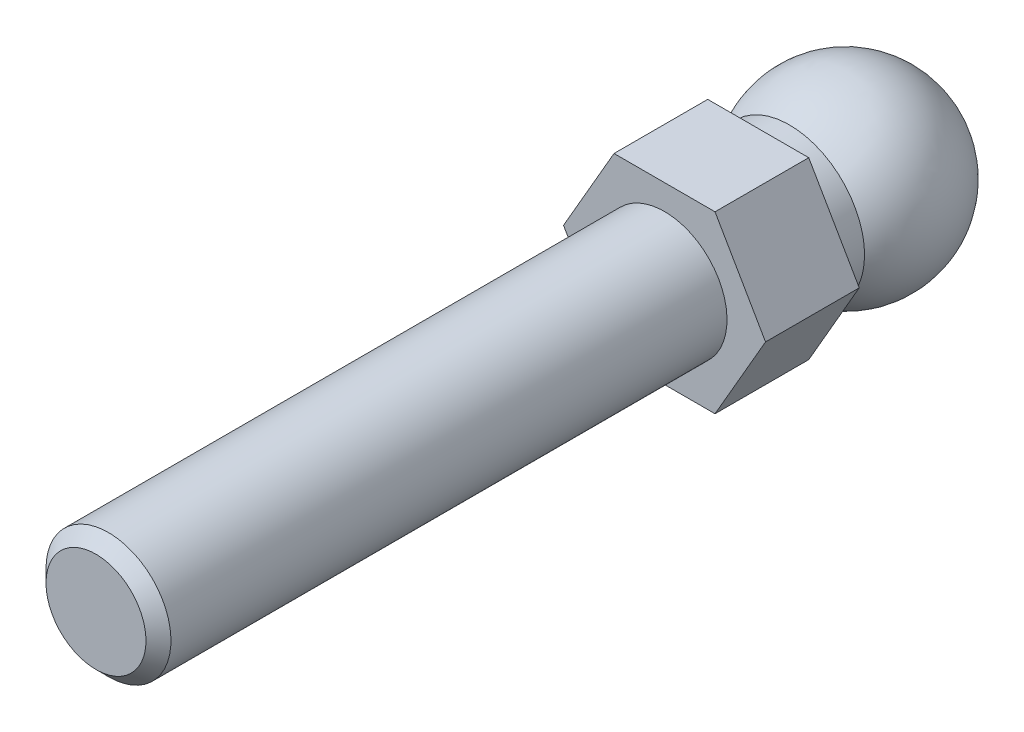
ISO-10303-21;
HEADER;
FILE_DESCRIPTION(('STEP AP214'),'2;1');
FILE_NAME('part.step','',(''),(''),'','','');
FILE_SCHEMA(('AUTOMOTIVE_DESIGN { 1 0 10303 214 1 1 1 1 }'));
ENDSEC;
DATA;
#1=APPLICATION_CONTEXT('core data for automotive mechanical design processes');
#2=APPLICATION_PROTOCOL_DEFINITION('international standard','automotive_design',2000,#1);
#3=PRODUCT_CONTEXT('',#1,'mechanical');
#4=PRODUCT('Part','Part','',(#3));
#5=PRODUCT_RELATED_PRODUCT_CATEGORY('part','',(#4));
#6=PRODUCT_DEFINITION_FORMATION('','',#4);
#7=PRODUCT_DEFINITION_CONTEXT('part definition',#1,'design');
#8=PRODUCT_DEFINITION('design','',#6,#7);
#9=PRODUCT_DEFINITION_SHAPE('','',#8);
#10=(LENGTH_UNIT() NAMED_UNIT(*) SI_UNIT(.MILLI.,.METRE.));
#11=(NAMED_UNIT(*) PLANE_ANGLE_UNIT() SI_UNIT($,.RADIAN.));
#12=(NAMED_UNIT(*) SI_UNIT($,.STERADIAN.) SOLID_ANGLE_UNIT());
#13=UNCERTAINTY_MEASURE_WITH_UNIT(LENGTH_MEASURE(1.E-05),#10,'distance_accuracy_value','');
#14=(GEOMETRIC_REPRESENTATION_CONTEXT(3) GLOBAL_UNCERTAINTY_ASSIGNED_CONTEXT((#13)) GLOBAL_UNIT_ASSIGNED_CONTEXT((#10,
#11,#12)) REPRESENTATION_CONTEXT('',''));
#15=CARTESIAN_POINT('',(0.,0.,0.));
#16=DIRECTION('',(0.,0.,1.));
#17=DIRECTION('',(1.,0.,0.));
#18=AXIS2_PLACEMENT_3D('',#15,#16,#17);
#19=CARTESIAN_POINT('',(0.,0.,0.));
#20=DIRECTION('',(1.,0.,0.));
#21=DIRECTION('',(0.,1.,0.));
#22=AXIS2_PLACEMENT_3D('',#19,#20,#21);
#23=SPHERICAL_SURFACE('',#22,7.5);
#24=CARTESIAN_POINT('',(-7.5,0.,0.));
#25=VERTEX_POINT('',#24);
#26=VERTEX_LOOP('',#25);
#27=FACE_BOUND('',#26,.T.);
#28=CARTESIAN_POINT('',(7.5,0.,0.));
#29=VERTEX_POINT('',#28);
#30=VERTEX_LOOP('',#29);
#31=FACE_BOUND('',#30,.T.);
#32=CARTESIAN_POINT('',(0.,0.,4.5));
#33=DIRECTION('',(0.,0.,1.));
#34=DIRECTION('',(1.,0.,0.));
#35=AXIS2_PLACEMENT_3D('',#32,#33,#34);
#36=CIRCLE('',#35,6.);
#37=CARTESIAN_POINT('',(6.,0.,4.5));
#38=VERTEX_POINT('',#37);
#39=EDGE_CURVE('E20',#38,#38,#36,.T.);
#40=ORIENTED_EDGE('',*,*,#39,.F.);
#41=EDGE_LOOP('',(#40));
#42=FACE_BOUND('',#41,.T.);
#43=ADVANCED_FACE('F16',(#27,#31,#42),#23,.T.);
#44=CARTESIAN_POINT('',(0.,0.,0.));
#45=DIRECTION('',(0.,0.,1.));
#46=DIRECTION('',(1.,0.,0.));
#47=AXIS2_PLACEMENT_3D('',#44,#45,#46);
#48=CYLINDRICAL_SURFACE('',#47,6.);
#49=ORIENTED_EDGE('',*,*,#39,.T.);
#50=EDGE_LOOP('',(#49));
#51=FACE_BOUND('',#50,.T.);
#52=CARTESIAN_POINT('',(0.,0.,7.));
#53=DIRECTION('',(0.,0.,1.));
#54=DIRECTION('',(1.,0.,0.));
#55=AXIS2_PLACEMENT_3D('',#52,#53,#54);
#56=CIRCLE('',#55,6.);
#57=CARTESIAN_POINT('',(6.,0.,7.));
#58=VERTEX_POINT('',#57);
#59=EDGE_CURVE('E79',#58,#58,#56,.F.);
#60=ORIENTED_EDGE('',*,*,#59,.T.);
#61=EDGE_LOOP('',(#60));
#62=FACE_BOUND('',#61,.T.);
#63=ADVANCED_FACE('F74',(#51,#62),#48,.T.);
#64=CARTESIAN_POINT('',(0.,0.,7.));
#65=DIRECTION('',(0.,0.,1.));
#66=DIRECTION('',(1.,0.,0.));
#67=AXIS2_PLACEMENT_3D('',#64,#65,#66);
#68=PLANE('',#67);
#69=ORIENTED_EDGE('',*,*,#59,.F.);
#70=EDGE_LOOP('',(#69));
#71=FACE_BOUND('',#70,.T.);
#72=DIRECTION('',(-0.500000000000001,0.866025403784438,0.));
#73=VECTOR('',#72,1.);
#74=CARTESIAN_POINT('',(4.04145188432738,7.,7.));
#75=LINE('',#74,#73);
#76=CARTESIAN_POINT('',(8.08290376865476,0.,7.));
#77=VERTEX_POINT('',#76);
#78=CARTESIAN_POINT('',(4.04145188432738,7.,7.));
#79=VERTEX_POINT('',#78);
#80=EDGE_CURVE('E81',#77,#79,#75,.T.);
#81=ORIENTED_EDGE('',*,*,#80,.F.);
#82=DIRECTION('',(0.5,0.866025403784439,0.));
#83=VECTOR('',#82,1.);
#84=CARTESIAN_POINT('',(8.08290376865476,0.,7.));
#85=LINE('',#84,#83);
#86=CARTESIAN_POINT('',(4.04145188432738,-7.,7.));
#87=VERTEX_POINT('',#86);
#88=EDGE_CURVE('E114',#87,#77,#85,.T.);
#89=ORIENTED_EDGE('',*,*,#88,.F.);
#90=DIRECTION('',(1.,0.,0.));
#91=VECTOR('',#90,1.);
#92=CARTESIAN_POINT('',(4.04145188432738,-7.,7.));
#93=LINE('',#92,#91);
#94=CARTESIAN_POINT('',(-4.04145188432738,-7.,7.));
#95=VERTEX_POINT('',#94);
#96=EDGE_CURVE('E111',#95,#87,#93,.T.);
#97=ORIENTED_EDGE('',*,*,#96,.F.);
#98=DIRECTION('',(0.5,-0.866025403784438,0.));
#99=VECTOR('',#98,1.);
#100=CARTESIAN_POINT('',(-4.04145188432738,-7.,7.));
#101=LINE('',#100,#99);
#102=CARTESIAN_POINT('',(-8.08290376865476,0.,7.));
#103=VERTEX_POINT('',#102);
#104=EDGE_CURVE('E106',#103,#95,#101,.T.);
#105=ORIENTED_EDGE('',*,*,#104,.F.);
#106=DIRECTION('',(-0.5,-0.866025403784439,0.));
#107=VECTOR('',#106,1.);
#108=CARTESIAN_POINT('',(-8.08290376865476,0.,7.));
#109=LINE('',#108,#107);
#110=CARTESIAN_POINT('',(-4.04145188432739,7.,7.));
#111=VERTEX_POINT('',#110);
#112=EDGE_CURVE('E101',#111,#103,#109,.T.);
#113=ORIENTED_EDGE('',*,*,#112,.F.);
#114=DIRECTION('',(1.,0.,0.));
#115=VECTOR('',#114,1.);
#116=CARTESIAN_POINT('',(-4.04145188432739,7.,7.));
#117=LINE('',#116,#115);
#118=EDGE_CURVE('E96',#79,#111,#117,.F.);
#119=ORIENTED_EDGE('',*,*,#118,.F.);
#120=EDGE_LOOP('',(#81,#89,#97,#105,#113,#119));
#121=FACE_BOUND('',#120,.T.);
#122=ADVANCED_FACE('F235',(#71,#121),#68,.F.);
#123=CARTESIAN_POINT('',(4.04145188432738,7.,7.));
#124=DIRECTION('',(0.866025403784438,0.500000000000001,0.));
#125=DIRECTION('',(-0.500000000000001,0.866025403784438,0.));
#126=AXIS2_PLACEMENT_3D('',#123,#124,#125);
#127=PLANE('',#126);
#128=ORIENTED_EDGE('',*,*,#80,.T.);
#129=DIRECTION('',(0.,0.,1.));
#130=VECTOR('',#129,1.);
#131=CARTESIAN_POINT('',(4.04145188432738,7.,7.));
#132=LINE('',#131,#130);
#133=CARTESIAN_POINT('',(4.04145188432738,7.,14.5));
#134=VERTEX_POINT('',#133);
#135=EDGE_CURVE('E84',#134,#79,#132,.F.);
#136=ORIENTED_EDGE('',*,*,#135,.F.);
#137=DIRECTION('',(-0.500000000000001,0.866025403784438,0.));
#138=VECTOR('',#137,1.);
#139=CARTESIAN_POINT('',(8.08290376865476,0.,14.5));
#140=LINE('',#139,#138);
#141=CARTESIAN_POINT('',(8.08290376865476,0.,14.5));
#142=VERTEX_POINT('',#141);
#143=EDGE_CURVE('E120',#142,#134,#140,.T.);
#144=ORIENTED_EDGE('',*,*,#143,.F.);
#145=DIRECTION('',(0.,0.,1.));
#146=VECTOR('',#145,1.);
#147=CARTESIAN_POINT('',(8.08290376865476,0.,7.));
#148=LINE('',#147,#146);
#149=EDGE_CURVE('E117',#77,#142,#148,.T.);
#150=ORIENTED_EDGE('',*,*,#149,.F.);
#151=EDGE_LOOP('',(#128,#136,#144,#150));
#152=FACE_BOUND('',#151,.T.);
#153=ADVANCED_FACE('F145',(#152),#127,.T.);
#154=CARTESIAN_POINT('',(-4.04145188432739,7.,7.));
#155=DIRECTION('',(0.,1.,0.));
#156=DIRECTION('',(0.,0.,1.));
#157=AXIS2_PLACEMENT_3D('',#154,#155,#156);
#158=PLANE('',#157);
#159=ORIENTED_EDGE('',*,*,#118,.T.);
#160=DIRECTION('',(0.,0.,1.));
#161=VECTOR('',#160,1.);
#162=CARTESIAN_POINT('',(-4.04145188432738,7.,7.));
#163=LINE('',#162,#161);
#164=CARTESIAN_POINT('',(-4.04145188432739,7.,14.5));
#165=VERTEX_POINT('',#164);
#166=EDGE_CURVE('E98',#165,#111,#163,.F.);
#167=ORIENTED_EDGE('',*,*,#166,.F.);
#168=DIRECTION('',(1.,0.,0.));
#169=VECTOR('',#168,1.);
#170=CARTESIAN_POINT('',(0.,7.,14.5));
#171=LINE('',#170,#169);
#172=EDGE_CURVE('E123',#134,#165,#171,.F.);
#173=ORIENTED_EDGE('',*,*,#172,.F.);
#174=ORIENTED_EDGE('',*,*,#135,.T.);
#175=EDGE_LOOP('',(#159,#167,#173,#174));
#176=FACE_BOUND('',#175,.T.);
#177=ADVANCED_FACE('F149',(#176),#158,.T.);
#178=CARTESIAN_POINT('',(-8.08290376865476,0.,7.));
#179=DIRECTION('',(-0.866025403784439,0.5,0.));
#180=DIRECTION('',(-0.5,-0.866025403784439,0.));
#181=AXIS2_PLACEMENT_3D('',#178,#179,#180);
#182=PLANE('',#181);
#183=ORIENTED_EDGE('',*,*,#112,.T.);
#184=DIRECTION('',(0.,0.,1.));
#185=VECTOR('',#184,1.);
#186=CARTESIAN_POINT('',(-8.08290376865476,0.,7.));
#187=LINE('',#186,#185);
#188=CARTESIAN_POINT('',(-8.08290376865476,0.,14.5));
#189=VERTEX_POINT('',#188);
#190=EDGE_CURVE('E103',#189,#103,#187,.F.);
#191=ORIENTED_EDGE('',*,*,#190,.F.);
#192=DIRECTION('',(-0.5,-0.866025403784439,0.));
#193=VECTOR('',#192,1.);
#194=CARTESIAN_POINT('',(-4.04145188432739,7.,14.5));
#195=LINE('',#194,#193);
#196=EDGE_CURVE('E126',#165,#189,#195,.T.);
#197=ORIENTED_EDGE('',*,*,#196,.F.);
#198=ORIENTED_EDGE('',*,*,#166,.T.);
#199=EDGE_LOOP('',(#183,#191,#197,#198));
#200=FACE_BOUND('',#199,.T.);
#201=ADVANCED_FACE('F153',(#200),#182,.T.);
#202=CARTESIAN_POINT('',(-4.04145188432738,-7.,7.));
#203=DIRECTION('',(-0.866025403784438,-0.5,0.));
#204=DIRECTION('',(0.5,-0.866025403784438,0.));
#205=AXIS2_PLACEMENT_3D('',#202,#203,#204);
#206=PLANE('',#205);
#207=ORIENTED_EDGE('',*,*,#104,.T.);
#208=DIRECTION('',(0.,0.,-1.));
#209=VECTOR('',#208,1.);
#210=CARTESIAN_POINT('',(-4.04145188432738,-7.,7.));
#211=LINE('',#210,#209);
#212=CARTESIAN_POINT('',(-4.04145188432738,-7.,14.5));
#213=VERTEX_POINT('',#212);
#214=EDGE_CURVE('E108',#213,#95,#211,.T.);
#215=ORIENTED_EDGE('',*,*,#214,.F.);
#216=DIRECTION('',(0.5,-0.866025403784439,0.));
#217=VECTOR('',#216,1.);
#218=CARTESIAN_POINT('',(-8.08290376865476,0.,14.5));
#219=LINE('',#218,#217);
#220=EDGE_CURVE('E129',#189,#213,#219,.T.);
#221=ORIENTED_EDGE('',*,*,#220,.F.);
#222=ORIENTED_EDGE('',*,*,#190,.T.);
#223=EDGE_LOOP('',(#207,#215,#221,#222));
#224=FACE_BOUND('',#223,.T.);
#225=ADVANCED_FACE('F157',(#224),#206,.T.);
#226=CARTESIAN_POINT('',(4.04145188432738,-7.,7.));
#227=DIRECTION('',(0.,-1.,0.));
#228=DIRECTION('',(0.,0.,-1.));
#229=AXIS2_PLACEMENT_3D('',#226,#227,#228);
#230=PLANE('',#229);
#231=ORIENTED_EDGE('',*,*,#96,.T.);
#232=DIRECTION('',(0.,0.,1.));
#233=VECTOR('',#232,1.);
#234=CARTESIAN_POINT('',(4.04145188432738,-7.,7.));
#235=LINE('',#234,#233);
#236=CARTESIAN_POINT('',(4.04145188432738,-7.,14.5));
#237=VERTEX_POINT('',#236);
#238=EDGE_CURVE('E35',#237,#87,#235,.F.);
#239=ORIENTED_EDGE('',*,*,#238,.F.);
#240=DIRECTION('',(1.,0.,0.));
#241=VECTOR('',#240,1.);
#242=CARTESIAN_POINT('',(0.,-7.,14.5));
#243=LINE('',#242,#241);
#244=EDGE_CURVE('E132',#213,#237,#243,.T.);
#245=ORIENTED_EDGE('',*,*,#244,.F.);
#246=ORIENTED_EDGE('',*,*,#214,.T.);
#247=EDGE_LOOP('',(#231,#239,#245,#246));
#248=FACE_BOUND('',#247,.T.);
#249=ADVANCED_FACE('F159',(#248),#230,.T.);
#250=CARTESIAN_POINT('',(8.08290376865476,0.,7.));
#251=DIRECTION('',(0.866025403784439,-0.5,0.));
#252=DIRECTION('',(0.5,0.866025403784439,0.));
#253=AXIS2_PLACEMENT_3D('',#250,#251,#252);
#254=PLANE('',#253);
#255=ORIENTED_EDGE('',*,*,#88,.T.);
#256=ORIENTED_EDGE('',*,*,#149,.T.);
#257=DIRECTION('',(0.5,0.866025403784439,0.));
#258=VECTOR('',#257,1.);
#259=CARTESIAN_POINT('',(4.04145188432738,-7.,14.5));
#260=LINE('',#259,#258);
#261=EDGE_CURVE('E90',#237,#142,#260,.T.);
#262=ORIENTED_EDGE('',*,*,#261,.F.);
#263=ORIENTED_EDGE('',*,*,#238,.T.);
#264=EDGE_LOOP('',(#255,#256,#262,#263));
#265=FACE_BOUND('',#264,.T.);
#266=ADVANCED_FACE('F141',(#265),#254,.T.);
#267=CARTESIAN_POINT('',(0.,0.,60.));
#268=DIRECTION('',(0.,0.,-1.));
#269=DIRECTION('',(-1.,0.,0.));
#270=AXIS2_PLACEMENT_3D('',#267,#268,#269);
#271=PLANE('',#270);
#272=CARTESIAN_POINT('',(0.,0.,60.0000000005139));
#273=DIRECTION('',(0.,0.,-1.));
#274=DIRECTION('',(-1.,0.,0.));
#275=AXIS2_PLACEMENT_3D('',#272,#273,#274);
#276=CIRCLE('',#275,4.000000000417);
#277=CARTESIAN_POINT('',(-4.000000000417,0.,60.0000000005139));
#278=VERTEX_POINT('',#277);
#279=EDGE_CURVE('E87',#278,#278,#276,.T.);
#280=ORIENTED_EDGE('',*,*,#279,.F.);
#281=EDGE_LOOP('',(#280));
#282=FACE_BOUND('',#281,.T.);
#283=ADVANCED_FACE('F167',(#282),#271,.F.);
#284=CARTESIAN_POINT('',(0.,0.,14.5));
#285=DIRECTION('',(0.,0.,1.));
#286=DIRECTION('',(1.,0.,0.));
#287=AXIS2_PLACEMENT_3D('',#284,#285,#286);
#288=PLANE('',#287);
#289=CARTESIAN_POINT('',(0.,0.,14.5));
#290=DIRECTION('',(0.,0.,1.));
#291=DIRECTION('',(0.,-1.,0.));
#292=AXIS2_PLACEMENT_3D('',#289,#290,#291);
#293=CIRCLE('',#292,5.);
#294=CARTESIAN_POINT('',(0.,-5.,14.5));
#295=VERTEX_POINT('',#294);
#296=EDGE_CURVE('E26',#295,#295,#293,.T.);
#297=ORIENTED_EDGE('',*,*,#296,.F.);
#298=EDGE_LOOP('',(#297));
#299=FACE_BOUND('',#298,.T.);
#300=ORIENTED_EDGE('',*,*,#244,.T.);
#301=ORIENTED_EDGE('',*,*,#261,.T.);
#302=ORIENTED_EDGE('',*,*,#143,.T.);
#303=ORIENTED_EDGE('',*,*,#172,.T.);
#304=ORIENTED_EDGE('',*,*,#196,.T.);
#305=ORIENTED_EDGE('',*,*,#220,.T.);
#306=EDGE_LOOP('',(#300,#301,#302,#303,#304,#305));
#307=FACE_BOUND('',#306,.T.);
#308=ADVANCED_FACE('F139',(#299,#307),#288,.T.);
#309=CARTESIAN_POINT('',(0.,0.,58.9999999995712));
#310=DIRECTION('',(0.,0.,-1.));
#311=DIRECTION('',(-1.,0.,0.));
#312=AXIS2_PLACEMENT_3D('',#309,#310,#311);
#313=CONICAL_SURFACE('',#312,4.99999999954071,0.785398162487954);
#314=CARTESIAN_POINT('',(0.,0.,59.));
#315=DIRECTION('',(0.,0.,1.));
#316=DIRECTION('',(0.,-1.,0.));
#317=AXIS2_PLACEMENT_3D('',#314,#315,#316);
#318=CIRCLE('',#317,5.);
#319=CARTESIAN_POINT('',(0.,-5.,59.));
#320=VERTEX_POINT('',#319);
#321=EDGE_CURVE('E11',#320,#320,#318,.F.);
#322=ORIENTED_EDGE('',*,*,#321,.F.);
#323=EDGE_LOOP('',(#322));
#324=FACE_BOUND('',#323,.T.);
#325=ORIENTED_EDGE('',*,*,#279,.T.);
#326=EDGE_LOOP('',(#325));
#327=FACE_BOUND('',#326,.T.);
#328=ADVANCED_FACE('F172',(#324,#327),#313,.T.);
#329=CARTESIAN_POINT('',(0.,0.,14.5));
#330=DIRECTION('',(0.,0.,1.));
#331=DIRECTION('',(0.,-1.,0.));
#332=AXIS2_PLACEMENT_3D('',#329,#330,#331);
#333=CYLINDRICAL_SURFACE('',#332,5.);
#334=ORIENTED_EDGE('',*,*,#321,.T.);
#335=EDGE_LOOP('',(#334));
#336=FACE_BOUND('',#335,.T.);
#337=ORIENTED_EDGE('',*,*,#296,.T.);
#338=EDGE_LOOP('',(#337));
#339=FACE_BOUND('',#338,.T.);
#340=ADVANCED_FACE('F170',(#336,#339),#333,.T.);
#341=CLOSED_SHELL('',(#43,#63,#122,#153,#177,#201,#225,#249,#266,#283,#308,#328,#340));
#342=MANIFOLD_SOLID_BREP('B1',#341);
#343=ADVANCED_BREP_SHAPE_REPRESENTATION('',(#18,#342),#14);
#344=SHAPE_DEFINITION_REPRESENTATION(#9,#343);
ENDSEC;
END-ISO-10303-21;
